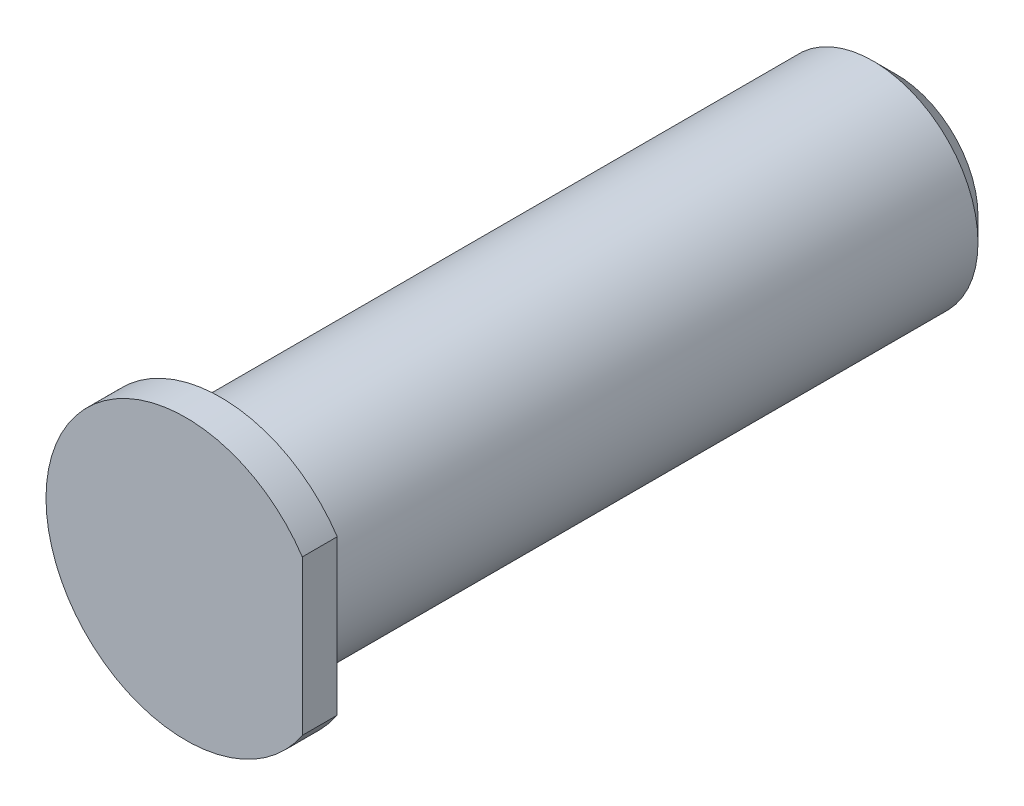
from build123d import *

# Parameters (mm, degrees)
ESQUISSE_CYLINDRE_R = 4.5
CYLINDRE_DEPTH      = 29
EPAULEMENT_DEPTH    = 1.5
ESQUISSE_TROU_R     = 2
TROU_DEPTH          = 3.5
CHANFREIN1_SIZE     = 1


with BuildPart() as part:
    # Esquisse_cylindre → Cylindre (new body)
    with BuildSketch(Plane.XY):
        Circle(ESQUISSE_CYLINDRE_R)
    extrude(amount=-CYLINDRE_DEPTH)

    # Esquisse__paulement → Epaulement (add)
    with BuildSketch(Plane.XY):
        with BuildLine():
            Line((5, 3.31662479), (5, -3.31662479))
            ThreePointArc((5, -3.31662479), (-6, 0), (5, 3.31662479))
        make_face()
    extrude(amount=EPAULEMENT_DEPTH)

    # Esquisse_trou → Trou (cut)
    with BuildSketch(Plane(origin=(0, 0, -29), x_dir=(-1, 0, 0), z_dir=(0, 0, -1))):
        Circle(ESQUISSE_TROU_R)
    extrude(amount=-TROU_DEPTH, mode=Mode.SUBTRACT)

    # Chanfrein1
    chanfrein1_edges = [part.edges().sort_by_distance(p)[0] for p in [
        (-4.5, 0, -29),
    ]]
    chamfer(chanfrein1_edges, length=CHANFREIN1_SIZE)


solid = part.part
